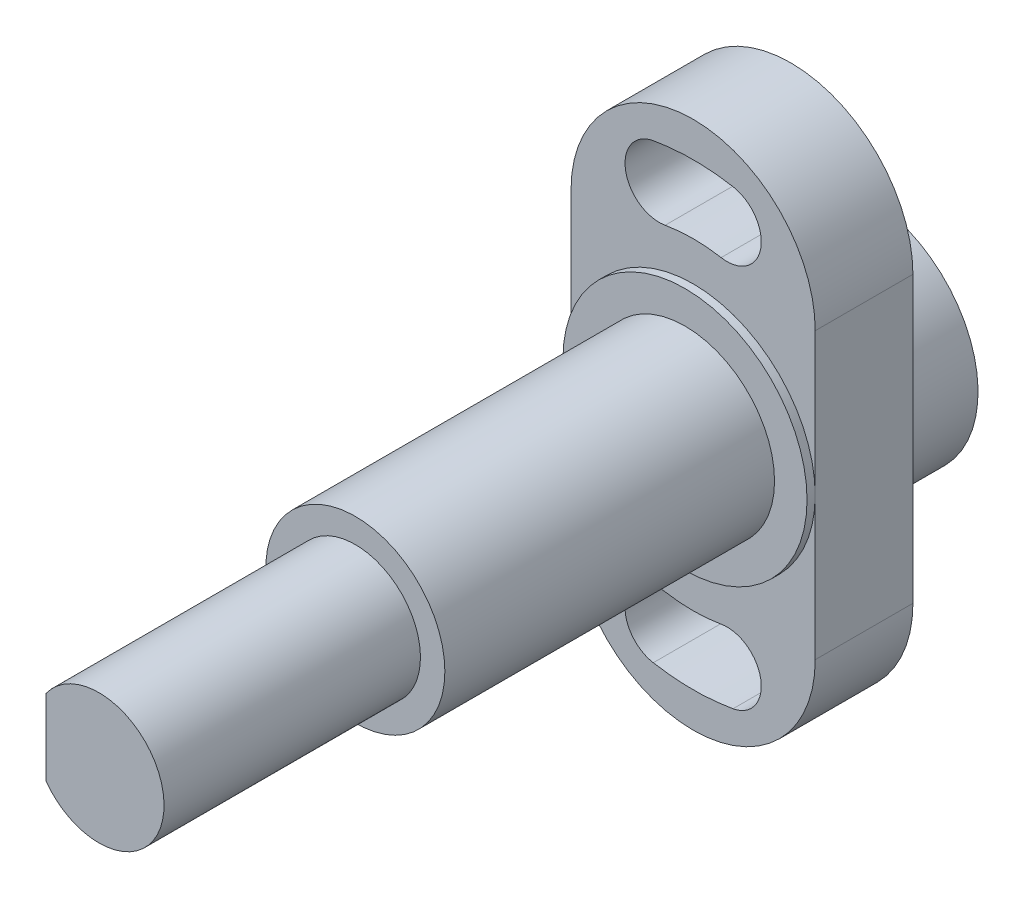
ISO-10303-21;
HEADER;
FILE_DESCRIPTION(('STEP AP214'),'2;1');
FILE_NAME('part.step','',(''),(''),'','','');
FILE_SCHEMA(('AUTOMOTIVE_DESIGN { 1 0 10303 214 1 1 1 1 }'));
ENDSEC;
DATA;
#1=APPLICATION_CONTEXT('core data for automotive mechanical design processes');
#2=APPLICATION_PROTOCOL_DEFINITION('international standard','automotive_design',2000,#1);
#3=PRODUCT_CONTEXT('',#1,'mechanical');
#4=PRODUCT('Part','Part','',(#3));
#5=PRODUCT_RELATED_PRODUCT_CATEGORY('part','',(#4));
#6=PRODUCT_DEFINITION_FORMATION('','',#4);
#7=PRODUCT_DEFINITION_CONTEXT('part definition',#1,'design');
#8=PRODUCT_DEFINITION('design','',#6,#7);
#9=PRODUCT_DEFINITION_SHAPE('','',#8);
#10=(LENGTH_UNIT() NAMED_UNIT(*) SI_UNIT(.MILLI.,.METRE.));
#11=(NAMED_UNIT(*) PLANE_ANGLE_UNIT() SI_UNIT($,.RADIAN.));
#12=(NAMED_UNIT(*) SI_UNIT($,.STERADIAN.) SOLID_ANGLE_UNIT());
#13=UNCERTAINTY_MEASURE_WITH_UNIT(LENGTH_MEASURE(1.E-05),#10,'distance_accuracy_value','');
#14=(GEOMETRIC_REPRESENTATION_CONTEXT(3) GLOBAL_UNCERTAINTY_ASSIGNED_CONTEXT((#13)) GLOBAL_UNIT_ASSIGNED_CONTEXT((#10,
#11,#12)) REPRESENTATION_CONTEXT('',''));
#15=CARTESIAN_POINT('',(0.,0.,0.));
#16=DIRECTION('',(0.,0.,1.));
#17=DIRECTION('',(1.,0.,0.));
#18=AXIS2_PLACEMENT_3D('',#15,#16,#17);
#19=CARTESIAN_POINT('',(0.,0.,-21.));
#20=DIRECTION('',(0.,0.,1.));
#21=DIRECTION('',(0.,1.,0.));
#22=AXIS2_PLACEMENT_3D('',#19,#20,#21);
#23=CYLINDRICAL_SURFACE('',#22,28.2);
#24=DIRECTION('',(0.,0.,1.));
#25=VECTOR('',#24,1.);
#26=CARTESIAN_POINT('',(4.89687861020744,-27.7715786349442,-21.));
#27=LINE('',#26,#25);
#28=CARTESIAN_POINT('',(4.89687861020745,-27.7715786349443,-12.));
#29=VERTEX_POINT('',#28);
#30=CARTESIAN_POINT('',(4.89687861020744,-27.7715786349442,0.));
#31=VERTEX_POINT('',#30);
#32=EDGE_CURVE('E194',#29,#31,#27,.T.);
#33=ORIENTED_EDGE('',*,*,#32,.F.);
#34=CARTESIAN_POINT('',(0.,0.,-12.));
#35=DIRECTION('',(0.,0.,-1.));
#36=DIRECTION('',(-1.,0.,0.));
#37=AXIS2_PLACEMENT_3D('',#34,#35,#36);
#38=CIRCLE('',#37,28.2);
#39=CARTESIAN_POINT('',(-4.89687861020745,-27.7715786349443,-12.));
#40=VERTEX_POINT('',#39);
#41=EDGE_CURVE('E140',#29,#40,#38,.T.);
#42=ORIENTED_EDGE('',*,*,#41,.T.);
#43=DIRECTION('',(0.,0.,1.));
#44=VECTOR('',#43,1.);
#45=CARTESIAN_POINT('',(-4.89687861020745,-27.7715786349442,-21.));
#46=LINE('',#45,#44);
#47=CARTESIAN_POINT('',(-4.89687861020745,-27.7715786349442,0.));
#48=VERTEX_POINT('',#47);
#49=EDGE_CURVE('E31',#40,#48,#46,.T.);
#50=ORIENTED_EDGE('',*,*,#49,.T.);
#51=CARTESIAN_POINT('',(0.,0.,0.));
#52=DIRECTION('',(0.,0.,-1.));
#53=DIRECTION('',(0.,-1.,0.));
#54=AXIS2_PLACEMENT_3D('',#51,#52,#53);
#55=CIRCLE('',#54,28.2);
#56=EDGE_CURVE('E255',#31,#48,#55,.T.);
#57=ORIENTED_EDGE('',*,*,#56,.F.);
#58=EDGE_LOOP('',(#33,#42,#50,#57));
#59=FACE_BOUND('',#58,.T.);
#60=ADVANCED_FACE('F14',(#59),#23,.F.);
#61=CARTESIAN_POINT('',(-4.16755626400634,-23.635386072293,-21.));
#62=DIRECTION('',(0.,0.,1.));
#63=DIRECTION('',(0.,1.,0.));
#64=AXIS2_PLACEMENT_3D('',#61,#62,#63);
#65=CYLINDRICAL_SURFACE('',#64,4.2);
#66=ORIENTED_EDGE('',*,*,#49,.F.);
#67=CARTESIAN_POINT('',(-4.16755626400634,-23.635386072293,-12.));
#68=DIRECTION('',(0.,0.,-1.));
#69=DIRECTION('',(-1.,0.,0.));
#70=AXIS2_PLACEMENT_3D('',#67,#68,#69);
#71=CIRCLE('',#70,4.2);
#72=CARTESIAN_POINT('',(-3.43823391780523,-19.4991935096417,-12.));
#73=VERTEX_POINT('',#72);
#74=EDGE_CURVE('E136',#40,#73,#71,.T.);
#75=ORIENTED_EDGE('',*,*,#74,.T.);
#76=DIRECTION('',(0.,0.,1.));
#77=VECTOR('',#76,1.);
#78=CARTESIAN_POINT('',(-3.43823391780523,-19.4991935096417,-21.));
#79=LINE('',#78,#77);
#80=CARTESIAN_POINT('',(-3.43823391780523,-19.4991935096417,0.));
#81=VERTEX_POINT('',#80);
#82=EDGE_CURVE('E125',#73,#81,#79,.T.);
#83=ORIENTED_EDGE('',*,*,#82,.T.);
#84=CARTESIAN_POINT('',(-4.16755626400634,-23.635386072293,0.));
#85=DIRECTION('',(0.,0.,-1.));
#86=DIRECTION('',(0.,-1.,0.));
#87=AXIS2_PLACEMENT_3D('',#84,#85,#86);
#88=CIRCLE('',#87,4.2);
#89=EDGE_CURVE('E253',#48,#81,#88,.T.);
#90=ORIENTED_EDGE('',*,*,#89,.F.);
#91=EDGE_LOOP('',(#66,#75,#83,#90));
#92=FACE_BOUND('',#91,.T.);
#93=ADVANCED_FACE('F137',(#92),#65,.F.);
#94=CARTESIAN_POINT('',(0.,0.,-21.));
#95=DIRECTION('',(0.,0.,1.));
#96=DIRECTION('',(0.,1.,0.));
#97=AXIS2_PLACEMENT_3D('',#94,#95,#96);
#98=CYLINDRICAL_SURFACE('',#97,19.8);
#99=ORIENTED_EDGE('',*,*,#82,.F.);
#100=CARTESIAN_POINT('',(0.,0.,-12.));
#101=DIRECTION('',(0.,0.,1.));
#102=DIRECTION('',(-1.,0.,0.));
#103=AXIS2_PLACEMENT_3D('',#100,#101,#102);
#104=CIRCLE('',#103,19.8);
#105=CARTESIAN_POINT('',(3.43823391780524,-19.4991935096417,-12.));
#106=VERTEX_POINT('',#105);
#107=EDGE_CURVE('E128',#73,#106,#104,.T.);
#108=ORIENTED_EDGE('',*,*,#107,.T.);
#109=DIRECTION('',(0.,0.,1.));
#110=VECTOR('',#109,1.);
#111=CARTESIAN_POINT('',(3.43823391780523,-19.4991935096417,-21.));
#112=LINE('',#111,#110);
#113=CARTESIAN_POINT('',(3.43823391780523,-19.4991935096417,0.));
#114=VERTEX_POINT('',#113);
#115=EDGE_CURVE('E133',#106,#114,#112,.T.);
#116=ORIENTED_EDGE('',*,*,#115,.T.);
#117=CARTESIAN_POINT('',(0.,0.,0.));
#118=DIRECTION('',(0.,0.,-1.));
#119=DIRECTION('',(0.,-1.,0.));
#120=AXIS2_PLACEMENT_3D('',#117,#118,#119);
#121=CIRCLE('',#120,19.8);
#122=EDGE_CURVE('E131',#81,#114,#121,.F.);
#123=ORIENTED_EDGE('',*,*,#122,.F.);
#124=EDGE_LOOP('',(#99,#108,#116,#123));
#125=FACE_BOUND('',#124,.T.);
#126=ADVANCED_FACE('F126',(#125),#98,.T.);
#127=CARTESIAN_POINT('',(4.16755626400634,-23.635386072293,-21.));
#128=DIRECTION('',(0.,0.,1.));
#129=DIRECTION('',(0.,1.,0.));
#130=AXIS2_PLACEMENT_3D('',#127,#128,#129);
#131=CYLINDRICAL_SURFACE('',#130,4.2);
#132=ORIENTED_EDGE('',*,*,#115,.F.);
#133=CARTESIAN_POINT('',(4.16755626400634,-23.635386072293,-12.));
#134=DIRECTION('',(0.,0.,-1.));
#135=DIRECTION('',(-1.,0.,0.));
#136=AXIS2_PLACEMENT_3D('',#133,#134,#135);
#137=CIRCLE('',#136,4.2);
#138=EDGE_CURVE('E144',#106,#29,#137,.T.);
#139=ORIENTED_EDGE('',*,*,#138,.T.);
#140=ORIENTED_EDGE('',*,*,#32,.T.);
#141=CARTESIAN_POINT('',(4.16755626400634,-23.635386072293,0.));
#142=DIRECTION('',(0.,0.,-1.));
#143=DIRECTION('',(0.,-1.,0.));
#144=AXIS2_PLACEMENT_3D('',#141,#142,#143);
#145=CIRCLE('',#144,4.2);
#146=EDGE_CURVE('E258',#114,#31,#145,.T.);
#147=ORIENTED_EDGE('',*,*,#146,.F.);
#148=EDGE_LOOP('',(#132,#139,#140,#147));
#149=FACE_BOUND('',#148,.T.);
#150=ADVANCED_FACE('F293',(#149),#131,.F.);
#151=CARTESIAN_POINT('',(0.,0.,-21.));
#152=DIRECTION('',(0.,0.,1.));
#153=DIRECTION('',(0.,1.,0.));
#154=AXIS2_PLACEMENT_3D('',#151,#152,#153);
#155=CYLINDRICAL_SURFACE('',#154,28.2);
#156=DIRECTION('',(0.,0.,1.));
#157=VECTOR('',#156,1.);
#158=CARTESIAN_POINT('',(-4.89687861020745,27.7715786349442,-21.));
#159=LINE('',#158,#157);
#160=CARTESIAN_POINT('',(-4.89687861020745,27.7715786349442,-12.));
#161=VERTEX_POINT('',#160);
#162=CARTESIAN_POINT('',(-4.89687861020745,27.7715786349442,0.));
#163=VERTEX_POINT('',#162);
#164=EDGE_CURVE('E39',#161,#163,#159,.T.);
#165=ORIENTED_EDGE('',*,*,#164,.F.);
#166=CARTESIAN_POINT('',(0.,0.,-12.));
#167=DIRECTION('',(0.,0.,-1.));
#168=DIRECTION('',(-1.,0.,0.));
#169=AXIS2_PLACEMENT_3D('',#166,#167,#168);
#170=CIRCLE('',#169,28.2);
#171=CARTESIAN_POINT('',(4.89687861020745,27.7715786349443,-12.));
#172=VERTEX_POINT('',#171);
#173=EDGE_CURVE('E151',#161,#172,#170,.T.);
#174=ORIENTED_EDGE('',*,*,#173,.T.);
#175=DIRECTION('',(0.,0.,1.));
#176=VECTOR('',#175,1.);
#177=CARTESIAN_POINT('',(4.89687861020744,27.7715786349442,-21.));
#178=LINE('',#177,#176);
#179=CARTESIAN_POINT('',(4.89687861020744,27.7715786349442,0.));
#180=VERTEX_POINT('',#179);
#181=EDGE_CURVE('E189',#172,#180,#178,.T.);
#182=ORIENTED_EDGE('',*,*,#181,.T.);
#183=CARTESIAN_POINT('',(0.,0.,0.));
#184=DIRECTION('',(0.,0.,-1.));
#185=DIRECTION('',(0.,-1.,0.));
#186=AXIS2_PLACEMENT_3D('',#183,#184,#185);
#187=CIRCLE('',#186,28.2);
#188=EDGE_CURVE('E23',#163,#180,#187,.T.);
#189=ORIENTED_EDGE('',*,*,#188,.F.);
#190=EDGE_LOOP('',(#165,#174,#182,#189));
#191=FACE_BOUND('',#190,.T.);
#192=ADVANCED_FACE('F341',(#191),#155,.F.);
#193=CARTESIAN_POINT('',(4.16755626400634,23.635386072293,-21.));
#194=DIRECTION('',(0.,0.,1.));
#195=DIRECTION('',(0.,1.,0.));
#196=AXIS2_PLACEMENT_3D('',#193,#194,#195);
#197=CYLINDRICAL_SURFACE('',#196,4.2);
#198=ORIENTED_EDGE('',*,*,#181,.F.);
#199=CARTESIAN_POINT('',(4.16755626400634,23.635386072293,-12.));
#200=DIRECTION('',(0.,0.,-1.));
#201=DIRECTION('',(-1.,0.,0.));
#202=AXIS2_PLACEMENT_3D('',#199,#200,#201);
#203=CIRCLE('',#202,4.2);
#204=CARTESIAN_POINT('',(3.43823391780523,19.4991935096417,-12.));
#205=VERTEX_POINT('',#204);
#206=EDGE_CURVE('E153',#172,#205,#203,.T.);
#207=ORIENTED_EDGE('',*,*,#206,.T.);
#208=DIRECTION('',(0.,0.,1.));
#209=VECTOR('',#208,1.);
#210=CARTESIAN_POINT('',(3.43823391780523,19.4991935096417,-21.));
#211=LINE('',#210,#209);
#212=CARTESIAN_POINT('',(3.43823391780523,19.4991935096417,0.));
#213=VERTEX_POINT('',#212);
#214=EDGE_CURVE('E191',#205,#213,#211,.T.);
#215=ORIENTED_EDGE('',*,*,#214,.T.);
#216=CARTESIAN_POINT('',(4.16755626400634,23.635386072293,0.));
#217=DIRECTION('',(0.,0.,-1.));
#218=DIRECTION('',(0.,-1.,0.));
#219=AXIS2_PLACEMENT_3D('',#216,#217,#218);
#220=CIRCLE('',#219,4.2);
#221=EDGE_CURVE('E264',#180,#213,#220,.T.);
#222=ORIENTED_EDGE('',*,*,#221,.F.);
#223=EDGE_LOOP('',(#198,#207,#215,#222));
#224=FACE_BOUND('',#223,.T.);
#225=ADVANCED_FACE('F434',(#224),#197,.F.);
#226=CARTESIAN_POINT('',(0.,0.,-21.));
#227=DIRECTION('',(0.,0.,1.));
#228=DIRECTION('',(0.,1.,0.));
#229=AXIS2_PLACEMENT_3D('',#226,#227,#228);
#230=CYLINDRICAL_SURFACE('',#229,19.8);
#231=ORIENTED_EDGE('',*,*,#214,.F.);
#232=CARTESIAN_POINT('',(0.,0.,-12.));
#233=DIRECTION('',(0.,0.,1.));
#234=DIRECTION('',(-1.,0.,0.));
#235=AXIS2_PLACEMENT_3D('',#232,#233,#234);
#236=CIRCLE('',#235,19.8);
#237=CARTESIAN_POINT('',(-3.43823391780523,19.4991935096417,-12.));
#238=VERTEX_POINT('',#237);
#239=EDGE_CURVE('E156',#205,#238,#236,.T.);
#240=ORIENTED_EDGE('',*,*,#239,.T.);
#241=DIRECTION('',(0.,0.,1.));
#242=VECTOR('',#241,1.);
#243=CARTESIAN_POINT('',(-3.43823391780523,19.4991935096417,-21.));
#244=LINE('',#243,#242);
#245=CARTESIAN_POINT('',(-3.43823391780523,19.4991935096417,0.));
#246=VERTEX_POINT('',#245);
#247=EDGE_CURVE('E187',#238,#246,#244,.T.);
#248=ORIENTED_EDGE('',*,*,#247,.T.);
#249=CARTESIAN_POINT('',(0.,0.,0.));
#250=DIRECTION('',(0.,0.,-1.));
#251=DIRECTION('',(0.,-1.,0.));
#252=AXIS2_PLACEMENT_3D('',#249,#250,#251);
#253=CIRCLE('',#252,19.8);
#254=EDGE_CURVE('E261',#213,#246,#253,.F.);
#255=ORIENTED_EDGE('',*,*,#254,.F.);
#256=EDGE_LOOP('',(#231,#240,#248,#255));
#257=FACE_BOUND('',#256,.T.);
#258=ADVANCED_FACE('F426',(#257),#230,.T.);
#259=CARTESIAN_POINT('',(-4.16755626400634,23.635386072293,-21.));
#260=DIRECTION('',(0.,0.,1.));
#261=DIRECTION('',(0.,1.,0.));
#262=AXIS2_PLACEMENT_3D('',#259,#260,#261);
#263=CYLINDRICAL_SURFACE('',#262,4.2);
#264=ORIENTED_EDGE('',*,*,#247,.F.);
#265=CARTESIAN_POINT('',(-4.16755626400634,23.635386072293,-12.));
#266=DIRECTION('',(0.,0.,-1.));
#267=DIRECTION('',(-1.,0.,0.));
#268=AXIS2_PLACEMENT_3D('',#265,#266,#267);
#269=CIRCLE('',#268,4.2);
#270=EDGE_CURVE('E146',#238,#161,#269,.T.);
#271=ORIENTED_EDGE('',*,*,#270,.T.);
#272=ORIENTED_EDGE('',*,*,#164,.T.);
#273=CARTESIAN_POINT('',(-4.16755626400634,23.635386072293,0.));
#274=DIRECTION('',(0.,0.,-1.));
#275=DIRECTION('',(0.,-1.,0.));
#276=AXIS2_PLACEMENT_3D('',#273,#274,#275);
#277=CIRCLE('',#276,4.2);
#278=EDGE_CURVE('E9',#246,#163,#277,.T.);
#279=ORIENTED_EDGE('',*,*,#278,.F.);
#280=EDGE_LOOP('',(#264,#271,#272,#279));
#281=FACE_BOUND('',#280,.T.);
#282=ADVANCED_FACE('F334',(#281),#263,.F.);
#283=CARTESIAN_POINT('',(-11.,0.,1.));
#284=DIRECTION('',(0.,0.,1.));
#285=DIRECTION('',(0.,1.,0.));
#286=AXIS2_PLACEMENT_3D('',#283,#284,#285);
#287=PLANE('',#286);
#288=CARTESIAN_POINT('',(0.,0.,1.));
#289=DIRECTION('',(0.,0.,1.));
#290=DIRECTION('',(0.,1.,0.));
#291=AXIS2_PLACEMENT_3D('',#288,#289,#290);
#292=CIRCLE('',#291,11.);
#293=CARTESIAN_POINT('',(0.,11.,1.));
#294=VERTEX_POINT('',#293);
#295=EDGE_CURVE('E238',#294,#294,#292,.F.);
#296=ORIENTED_EDGE('',*,*,#295,.T.);
#297=EDGE_LOOP('',(#296));
#298=FACE_BOUND('',#297,.T.);
#299=CARTESIAN_POINT('',(0.,0.,1.));
#300=DIRECTION('',(0.,0.,-1.));
#301=DIRECTION('',(0.,-1.,0.));
#302=AXIS2_PLACEMENT_3D('',#299,#300,#301);
#303=CIRCLE('',#302,14.995);
#304=CARTESIAN_POINT('',(0.,-14.995,1.));
#305=VERTEX_POINT('',#304);
#306=EDGE_CURVE('E235',#305,#305,#303,.T.);
#307=ORIENTED_EDGE('',*,*,#306,.F.);
#308=EDGE_LOOP('',(#307));
#309=FACE_BOUND('',#308,.T.);
#310=ADVANCED_FACE('F322',(#298,#309),#287,.T.);
#311=CARTESIAN_POINT('',(-15.,10.,-6.));
#312=DIRECTION('',(-1.,0.,0.));
#313=DIRECTION('',(0.,-1.,0.));
#314=AXIS2_PLACEMENT_3D('',#311,#312,#313);
#315=CONICAL_SURFACE('',#314,2.65,0.78539816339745);
#316=CARTESIAN_POINT('',(-14.85,10.,-6.));
#317=DIRECTION('',(-1.,0.,0.));
#318=DIRECTION('',(0.,0.,1.));
#319=AXIS2_PLACEMENT_3D('',#316,#317,#318);
#320=CIRCLE('',#319,2.5);
#321=CARTESIAN_POINT('',(-14.85,10.,-3.5));
#322=VERTEX_POINT('',#321);
#323=EDGE_CURVE('E277',#322,#322,#320,.F.);
#324=ORIENTED_EDGE('',*,*,#323,.T.);
#325=EDGE_LOOP('',(#324));
#326=FACE_BOUND('',#325,.T.);
#327=CARTESIAN_POINT('',(-15.,10.,-6.));
#328=DIRECTION('',(-1.,0.,0.));
#329=DIRECTION('',(0.,-1.,0.));
#330=AXIS2_PLACEMENT_3D('',#327,#328,#329);
#331=CIRCLE('',#330,2.65);
#332=CARTESIAN_POINT('',(-15.,7.35,-6.));
#333=VERTEX_POINT('',#332);
#334=EDGE_CURVE('E177',#333,#333,#331,.T.);
#335=ORIENTED_EDGE('',*,*,#334,.T.);
#336=EDGE_LOOP('',(#335));
#337=FACE_BOUND('',#336,.T.);
#338=ADVANCED_FACE('F310',(#326,#337),#315,.F.);
#339=CARTESIAN_POINT('',(0.,0.,-12.));
#340=DIRECTION('',(0.,0.,-1.));
#341=DIRECTION('',(0.,-1.,0.));
#342=AXIS2_PLACEMENT_3D('',#339,#340,#341);
#343=CYLINDRICAL_SURFACE('',#342,14.995);
#344=ORIENTED_EDGE('',*,*,#306,.T.);
#345=EDGE_LOOP('',(#344));
#346=FACE_BOUND('',#345,.T.);
#347=CARTESIAN_POINT('',(0.,0.,0.));
#348=DIRECTION('',(0.,0.,1.));
#349=DIRECTION('',(0.,1.,0.));
#350=AXIS2_PLACEMENT_3D('',#347,#348,#349);
#351=CIRCLE('',#350,14.995);
#352=CARTESIAN_POINT('',(0.,14.995,0.));
#353=VERTEX_POINT('',#352);
#354=EDGE_CURVE('E215',#353,#353,#351,.T.);
#355=ORIENTED_EDGE('',*,*,#354,.T.);
#356=EDGE_LOOP('',(#355));
#357=FACE_BOUND('',#356,.T.);
#358=ADVANCED_FACE('F307',(#346,#357),#343,.T.);
#359=CARTESIAN_POINT('',(15.,-17.5,0.));
#360=DIRECTION('',(-1.,0.,0.));
#361=DIRECTION('',(0.,-1.,0.));
#362=AXIS2_PLACEMENT_3D('',#359,#360,#361);
#363=PLANE('',#362);
#364=DIRECTION('',(0.,-1.,0.));
#365=VECTOR('',#364,1.);
#366=CARTESIAN_POINT('',(15.,17.5,-12.));
#367=LINE('',#366,#365);
#368=CARTESIAN_POINT('',(15.,17.5,-12.));
#369=VERTEX_POINT('',#368);
#370=CARTESIAN_POINT('',(15.,-17.5,-12.));
#371=VERTEX_POINT('',#370);
#372=EDGE_CURVE('E165',#369,#371,#367,.T.);
#373=ORIENTED_EDGE('',*,*,#372,.F.);
#374=DIRECTION('',(0.,0.,-1.));
#375=VECTOR('',#374,1.);
#376=CARTESIAN_POINT('',(15.,17.5,0.));
#377=LINE('',#376,#375);
#378=CARTESIAN_POINT('',(15.,17.5,0.));
#379=VERTEX_POINT('',#378);
#380=EDGE_CURVE('E227',#379,#369,#377,.T.);
#381=ORIENTED_EDGE('',*,*,#380,.F.);
#382=DIRECTION('',(0.,1.,0.));
#383=VECTOR('',#382,1.);
#384=CARTESIAN_POINT('',(15.,-17.5,0.));
#385=LINE('',#384,#383);
#386=CARTESIAN_POINT('',(15.,-17.5,0.));
#387=VERTEX_POINT('',#386);
#388=EDGE_CURVE('E225',#387,#379,#385,.T.);
#389=ORIENTED_EDGE('',*,*,#388,.F.);
#390=DIRECTION('',(0.,0.,-1.));
#391=VECTOR('',#390,1.);
#392=CARTESIAN_POINT('',(15.,-17.5,0.));
#393=LINE('',#392,#391);
#394=EDGE_CURVE('E229',#387,#371,#393,.T.);
#395=ORIENTED_EDGE('',*,*,#394,.T.);
#396=EDGE_LOOP('',(#373,#381,#389,#395));
#397=FACE_BOUND('',#396,.T.);
#398=ADVANCED_FACE('F309',(#397),#363,.F.);
#399=CARTESIAN_POINT('',(0.,17.5,0.));
#400=DIRECTION('',(0.,0.,-1.));
#401=DIRECTION('',(0.,-1.,0.));
#402=AXIS2_PLACEMENT_3D('',#399,#400,#401);
#403=CYLINDRICAL_SURFACE('',#402,15.);
#404=CARTESIAN_POINT('',(0.,17.5,-12.));
#405=DIRECTION('',(0.,0.,-1.));
#406=DIRECTION('',(-1.,0.,0.));
#407=AXIS2_PLACEMENT_3D('',#404,#405,#406);
#408=CIRCLE('',#407,15.);
#409=CARTESIAN_POINT('',(-15.,17.5,-12.));
#410=VERTEX_POINT('',#409);
#411=EDGE_CURVE('E162',#410,#369,#408,.T.);
#412=ORIENTED_EDGE('',*,*,#411,.F.);
#413=DIRECTION('',(0.,0.,-1.));
#414=VECTOR('',#413,1.);
#415=CARTESIAN_POINT('',(-15.,17.5,0.));
#416=LINE('',#415,#414);
#417=CARTESIAN_POINT('',(-15.,17.5,0.));
#418=VERTEX_POINT('',#417);
#419=EDGE_CURVE('E233',#418,#410,#416,.T.);
#420=ORIENTED_EDGE('',*,*,#419,.F.);
#421=CARTESIAN_POINT('',(0.,17.5,0.));
#422=DIRECTION('',(0.,0.,1.));
#423=DIRECTION('',(0.,-1.,0.));
#424=AXIS2_PLACEMENT_3D('',#421,#422,#423);
#425=CIRCLE('',#424,15.);
#426=EDGE_CURVE('E218',#379,#418,#425,.T.);
#427=ORIENTED_EDGE('',*,*,#426,.F.);
#428=ORIENTED_EDGE('',*,*,#380,.T.);
#429=EDGE_LOOP('',(#412,#420,#427,#428));
#430=FACE_BOUND('',#429,.T.);
#431=ADVANCED_FACE('F319',(#430),#403,.T.);
#432=CARTESIAN_POINT('',(-15.,-17.5,0.));
#433=DIRECTION('',(1.,0.,0.));
#434=DIRECTION('',(0.,1.,0.));
#435=AXIS2_PLACEMENT_3D('',#432,#433,#434);
#436=PLANE('',#435);
#437=DIRECTION('',(0.,1.,0.));
#438=VECTOR('',#437,1.);
#439=CARTESIAN_POINT('',(-15.,-17.5,-12.));
#440=LINE('',#439,#438);
#441=CARTESIAN_POINT('',(-15.,-17.5,-12.));
#442=VERTEX_POINT('',#441);
#443=EDGE_CURVE('E171',#442,#410,#440,.T.);
#444=ORIENTED_EDGE('',*,*,#443,.F.);
#445=DIRECTION('',(0.,0.,-1.));
#446=VECTOR('',#445,1.);
#447=CARTESIAN_POINT('',(-15.,-17.5,0.));
#448=LINE('',#447,#446);
#449=CARTESIAN_POINT('',(-15.,-17.5,0.));
#450=VERTEX_POINT('',#449);
#451=EDGE_CURVE('E231',#450,#442,#448,.T.);
#452=ORIENTED_EDGE('',*,*,#451,.F.);
#453=DIRECTION('',(0.,-1.,0.));
#454=VECTOR('',#453,1.);
#455=CARTESIAN_POINT('',(-15.,-17.5,0.));
#456=LINE('',#455,#454);
#457=EDGE_CURVE('E221',#418,#450,#456,.T.);
#458=ORIENTED_EDGE('',*,*,#457,.F.);
#459=ORIENTED_EDGE('',*,*,#419,.T.);
#460=EDGE_LOOP('',(#444,#452,#458,#459));
#461=FACE_BOUND('',#460,.T.);
#462=ORIENTED_EDGE('',*,*,#334,.F.);
#463=EDGE_LOOP('',(#462));
#464=FACE_BOUND('',#463,.T.);
#465=ADVANCED_FACE('F384',(#461,#464),#436,.F.);
#466=CARTESIAN_POINT('',(0.,-17.5,0.));
#467=DIRECTION('',(0.,0.,-1.));
#468=DIRECTION('',(0.,-1.,0.));
#469=AXIS2_PLACEMENT_3D('',#466,#467,#468);
#470=CYLINDRICAL_SURFACE('',#469,15.);
#471=CARTESIAN_POINT('',(0.,-17.5,-12.));
#472=DIRECTION('',(0.,0.,-1.));
#473=DIRECTION('',(-1.,0.,0.));
#474=AXIS2_PLACEMENT_3D('',#471,#472,#473);
#475=CIRCLE('',#474,15.);
#476=EDGE_CURVE('E168',#371,#442,#475,.T.);
#477=ORIENTED_EDGE('',*,*,#476,.F.);
#478=ORIENTED_EDGE('',*,*,#394,.F.);
#479=CARTESIAN_POINT('',(0.,-17.5,0.));
#480=DIRECTION('',(0.,0.,1.));
#481=DIRECTION('',(0.,1.,0.));
#482=AXIS2_PLACEMENT_3D('',#479,#480,#481);
#483=CIRCLE('',#482,15.);
#484=EDGE_CURVE('E223',#450,#387,#483,.T.);
#485=ORIENTED_EDGE('',*,*,#484,.F.);
#486=ORIENTED_EDGE('',*,*,#451,.T.);
#487=EDGE_LOOP('',(#477,#478,#485,#486));
#488=FACE_BOUND('',#487,.T.);
#489=ADVANCED_FACE('F299',(#488),#470,.T.);
#490=CARTESIAN_POINT('',(0.,17.5,0.));
#491=DIRECTION('',(0.,0.,-1.));
#492=DIRECTION('',(0.,-1.,0.));
#493=AXIS2_PLACEMENT_3D('',#490,#491,#492);
#494=PLANE('',#493);
#495=ORIENTED_EDGE('',*,*,#254,.T.);
#496=ORIENTED_EDGE('',*,*,#278,.T.);
#497=ORIENTED_EDGE('',*,*,#188,.T.);
#498=ORIENTED_EDGE('',*,*,#221,.T.);
#499=EDGE_LOOP('',(#495,#496,#497,#498));
#500=FACE_BOUND('',#499,.T.);
#501=ORIENTED_EDGE('',*,*,#122,.T.);
#502=ORIENTED_EDGE('',*,*,#146,.T.);
#503=ORIENTED_EDGE('',*,*,#56,.T.);
#504=ORIENTED_EDGE('',*,*,#89,.T.);
#505=EDGE_LOOP('',(#501,#502,#503,#504));
#506=FACE_BOUND('',#505,.T.);
#507=ORIENTED_EDGE('',*,*,#426,.T.);
#508=ORIENTED_EDGE('',*,*,#457,.T.);
#509=ORIENTED_EDGE('',*,*,#484,.T.);
#510=ORIENTED_EDGE('',*,*,#388,.T.);
#511=EDGE_LOOP('',(#507,#508,#509,#510));
#512=FACE_BOUND('',#511,.T.);
#513=ORIENTED_EDGE('',*,*,#354,.F.);
#514=EDGE_LOOP('',(#513));
#515=FACE_BOUND('',#514,.T.);
#516=ADVANCED_FACE('F295',(#500,#506,#512,#515),#494,.F.);
#517=CARTESIAN_POINT('',(-8.,0.,-21.));
#518=DIRECTION('',(0.,0.,-1.));
#519=DIRECTION('',(0.,-1.,0.));
#520=AXIS2_PLACEMENT_3D('',#517,#518,#519);
#521=PLANE('',#520);
#522=CARTESIAN_POINT('',(0.,0.,-21.));
#523=DIRECTION('',(0.,0.,-1.));
#524=DIRECTION('',(0.,-1.,0.));
#525=AXIS2_PLACEMENT_3D('',#522,#523,#524);
#526=CIRCLE('',#525,14.);
#527=CARTESIAN_POINT('',(0.,-14.,-21.));
#528=VERTEX_POINT('',#527);
#529=EDGE_CURVE('E196',#528,#528,#526,.T.);
#530=ORIENTED_EDGE('',*,*,#529,.T.);
#531=EDGE_LOOP('',(#530));
#532=FACE_BOUND('',#531,.T.);
#533=ADVANCED_FACE('F298',(#532),#521,.T.);
#534=CARTESIAN_POINT('',(0.,0.,-12.));
#535=DIRECTION('',(0.,0.,-1.));
#536=DIRECTION('',(0.,-1.,0.));
#537=AXIS2_PLACEMENT_3D('',#534,#535,#536);
#538=CYLINDRICAL_SURFACE('',#537,14.);
#539=CARTESIAN_POINT('',(0.,0.,-12.));
#540=DIRECTION('',(0.,0.,-1.));
#541=DIRECTION('',(0.,-1.,0.));
#542=AXIS2_PLACEMENT_3D('',#539,#540,#541);
#543=CIRCLE('',#542,14.);
#544=CARTESIAN_POINT('',(0.,-14.,-12.));
#545=VERTEX_POINT('',#544);
#546=EDGE_CURVE('E249',#545,#545,#543,.T.);
#547=ORIENTED_EDGE('',*,*,#546,.T.);
#548=EDGE_LOOP('',(#547));
#549=FACE_BOUND('',#548,.T.);
#550=ORIENTED_EDGE('',*,*,#529,.F.);
#551=EDGE_LOOP('',(#550));
#552=FACE_BOUND('',#551,.T.);
#553=ADVANCED_FACE('F342',(#549,#552),#538,.T.);
#554=CARTESIAN_POINT('',(-8.,0.,-12.));
#555=DIRECTION('',(0.,0.,-1.));
#556=DIRECTION('',(0.,-1.,0.));
#557=AXIS2_PLACEMENT_3D('',#554,#555,#556);
#558=PLANE('',#557);
#559=ORIENTED_EDGE('',*,*,#41,.F.);
#560=ORIENTED_EDGE('',*,*,#138,.F.);
#561=ORIENTED_EDGE('',*,*,#107,.F.);
#562=ORIENTED_EDGE('',*,*,#74,.F.);
#563=EDGE_LOOP('',(#559,#560,#561,#562));
#564=FACE_BOUND('',#563,.T.);
#565=ORIENTED_EDGE('',*,*,#270,.F.);
#566=ORIENTED_EDGE('',*,*,#239,.F.);
#567=ORIENTED_EDGE('',*,*,#206,.F.);
#568=ORIENTED_EDGE('',*,*,#173,.F.);
#569=EDGE_LOOP('',(#565,#566,#567,#568));
#570=FACE_BOUND('',#569,.T.);
#571=ORIENTED_EDGE('',*,*,#546,.F.);
#572=EDGE_LOOP('',(#571));
#573=FACE_BOUND('',#572,.T.);
#574=ORIENTED_EDGE('',*,*,#411,.T.);
#575=ORIENTED_EDGE('',*,*,#372,.T.);
#576=ORIENTED_EDGE('',*,*,#476,.T.);
#577=ORIENTED_EDGE('',*,*,#443,.T.);
#578=EDGE_LOOP('',(#574,#575,#576,#577));
#579=FACE_BOUND('',#578,.T.);
#580=ADVANCED_FACE('F16',(#564,#570,#573,#579),#558,.T.);
#581=CARTESIAN_POINT('',(0.,0.,-12.));
#582=DIRECTION('',(0.,0.,-1.));
#583=DIRECTION('',(0.,-1.,0.));
#584=AXIS2_PLACEMENT_3D('',#581,#582,#583);
#585=CYLINDRICAL_SURFACE('',#584,11.);
#586=ORIENTED_EDGE('',*,*,#295,.F.);
#587=EDGE_LOOP('',(#586));
#588=FACE_BOUND('',#587,.T.);
#589=CARTESIAN_POINT('',(0.,0.,41.5));
#590=DIRECTION('',(0.,0.,1.));
#591=DIRECTION('',(1.,0.,0.));
#592=AXIS2_PLACEMENT_3D('',#589,#590,#591);
#593=CIRCLE('',#592,11.);
#594=CARTESIAN_POINT('',(11.,0.,41.5));
#595=VERTEX_POINT('',#594);
#596=EDGE_CURVE('E174',#595,#595,#593,.T.);
#597=ORIENTED_EDGE('',*,*,#596,.F.);
#598=EDGE_LOOP('',(#597));
#599=FACE_BOUND('',#598,.T.);
#600=ADVANCED_FACE('F353',(#588,#599),#585,.T.);
#601=CARTESIAN_POINT('',(-6.5,0.,69.));
#602=DIRECTION('',(-1.,0.,0.));
#603=DIRECTION('',(0.,-1.,0.));
#604=AXIS2_PLACEMENT_3D('',#601,#602,#603);
#605=CONICAL_SURFACE('',#604,2.65,0.785398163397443);
#606=CARTESIAN_POINT('',(-6.35,0.,69.));
#607=DIRECTION('',(-1.,0.,0.));
#608=DIRECTION('',(0.,0.,1.));
#609=AXIS2_PLACEMENT_3D('',#606,#607,#608);
#610=CIRCLE('',#609,2.5);
#611=CARTESIAN_POINT('',(-6.35,0.,71.5));
#612=VERTEX_POINT('',#611);
#613=EDGE_CURVE('E271',#612,#612,#610,.F.);
#614=ORIENTED_EDGE('',*,*,#613,.T.);
#615=EDGE_LOOP('',(#614));
#616=FACE_BOUND('',#615,.T.);
#617=CARTESIAN_POINT('',(-6.5,0.,69.));
#618=DIRECTION('',(-1.,0.,0.));
#619=DIRECTION('',(0.,-1.,0.));
#620=AXIS2_PLACEMENT_3D('',#617,#618,#619);
#621=CIRCLE('',#620,2.65);
#622=CARTESIAN_POINT('',(-6.5,-2.65,69.));
#623=VERTEX_POINT('',#622);
#624=EDGE_CURVE('E201',#623,#623,#621,.T.);
#625=ORIENTED_EDGE('',*,*,#624,.T.);
#626=EDGE_LOOP('',(#625));
#627=FACE_BOUND('',#626,.T.);
#628=ADVANCED_FACE('F349',(#616,#627),#605,.F.);
#629=CARTESIAN_POINT('',(-6.5,-10.,63.));
#630=DIRECTION('',(0.500000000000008,0.,-0.866025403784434));
#631=DIRECTION('',(-0.866025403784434,0.,-0.500000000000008));
#632=AXIS2_PLACEMENT_3D('',#629,#630,#631);
#633=PLANE('',#632);
#634=CARTESIAN_POINT('',(0.,0.,66.7527767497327));
#635=DIRECTION('',(0.500000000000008,0.,-0.866025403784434));
#636=DIRECTION('',(-0.866025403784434,0.,-0.500000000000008));
#637=AXIS2_PLACEMENT_3D('',#634,#635,#636);
#638=ELLIPSE('',#637,9.23760430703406,8.);
#639=CARTESIAN_POINT('',(-6.5,-4.66368952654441,63.));
#640=VERTEX_POINT('',#639);
#641=CARTESIAN_POINT('',(-6.5,4.6636895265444,63.));
#642=VERTEX_POINT('',#641);
#643=EDGE_CURVE('E241',#640,#642,#638,.T.);
#644=ORIENTED_EDGE('',*,*,#643,.F.);
#645=DIRECTION('',(0.,1.,0.));
#646=VECTOR('',#645,1.);
#647=CARTESIAN_POINT('',(-6.5,-10.,63.));
#648=LINE('',#647,#646);
#649=EDGE_CURVE('E207',#640,#642,#648,.T.);
#650=ORIENTED_EDGE('',*,*,#649,.T.);
#651=EDGE_LOOP('',(#644,#650));
#652=FACE_BOUND('',#651,.T.);
#653=ADVANCED_FACE('F352',(#652),#633,.F.);
#654=CARTESIAN_POINT('',(0.,0.,73.));
#655=DIRECTION('',(0.,0.,1.));
#656=DIRECTION('',(0.,1.,0.));
#657=AXIS2_PLACEMENT_3D('',#654,#655,#656);
#658=PLANE('',#657);
#659=DIRECTION('',(0.,1.,0.));
#660=VECTOR('',#659,1.);
#661=CARTESIAN_POINT('',(-6.5,-10.,73.));
#662=LINE('',#661,#660);
#663=CARTESIAN_POINT('',(-6.5,-4.6636895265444,73.));
#664=VERTEX_POINT('',#663);
#665=CARTESIAN_POINT('',(-6.5,4.6636895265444,73.));
#666=VERTEX_POINT('',#665);
#667=EDGE_CURVE('E208',#664,#666,#662,.T.);
#668=ORIENTED_EDGE('',*,*,#667,.F.);
#669=CARTESIAN_POINT('',(0.,0.,73.));
#670=DIRECTION('',(0.,0.,1.));
#671=DIRECTION('',(1.,0.,0.));
#672=AXIS2_PLACEMENT_3D('',#669,#670,#671);
#673=CIRCLE('',#672,8.);
#674=EDGE_CURVE('E159',#664,#666,#673,.T.);
#675=ORIENTED_EDGE('',*,*,#674,.T.);
#676=EDGE_LOOP('',(#668,#675));
#677=FACE_BOUND('',#676,.T.);
#678=ADVANCED_FACE('F367',(#677),#658,.T.);
#679=CARTESIAN_POINT('',(-6.5,-10.,73.));
#680=DIRECTION('',(1.,0.,0.));
#681=DIRECTION('',(0.,0.,-1.));
#682=AXIS2_PLACEMENT_3D('',#679,#680,#681);
#683=PLANE('',#682);
#684=ORIENTED_EDGE('',*,*,#667,.T.);
#685=DIRECTION('',(0.,0.,-1.));
#686=VECTOR('',#685,1.);
#687=CARTESIAN_POINT('',(-6.5,4.6636895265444,-12.));
#688=LINE('',#687,#686);
#689=EDGE_CURVE('E243',#642,#666,#688,.F.);
#690=ORIENTED_EDGE('',*,*,#689,.F.);
#691=ORIENTED_EDGE('',*,*,#649,.F.);
#692=DIRECTION('',(0.,0.,-1.));
#693=VECTOR('',#692,1.);
#694=CARTESIAN_POINT('',(-6.5,-4.6636895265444,-12.));
#695=LINE('',#694,#693);
#696=EDGE_CURVE('E246',#664,#640,#695,.T.);
#697=ORIENTED_EDGE('',*,*,#696,.F.);
#698=EDGE_LOOP('',(#684,#690,#691,#697));
#699=FACE_BOUND('',#698,.T.);
#700=ORIENTED_EDGE('',*,*,#624,.F.);
#701=EDGE_LOOP('',(#700));
#702=FACE_BOUND('',#701,.T.);
#703=ADVANCED_FACE('F369',(#699,#702),#683,.F.);
#704=CARTESIAN_POINT('',(0.,0.,-12.));
#705=DIRECTION('',(0.,0.,-1.));
#706=DIRECTION('',(0.,-1.,0.));
#707=AXIS2_PLACEMENT_3D('',#704,#705,#706);
#708=CYLINDRICAL_SURFACE('',#707,8.);
#709=ORIENTED_EDGE('',*,*,#689,.T.);
#710=ORIENTED_EDGE('',*,*,#674,.F.);
#711=ORIENTED_EDGE('',*,*,#696,.T.);
#712=ORIENTED_EDGE('',*,*,#643,.T.);
#713=EDGE_LOOP('',(#709,#710,#711,#712));
#714=FACE_BOUND('',#713,.T.);
#715=CARTESIAN_POINT('',(0.,0.,41.5));
#716=DIRECTION('',(0.,0.,-1.));
#717=DIRECTION('',(0.,-1.,0.));
#718=AXIS2_PLACEMENT_3D('',#715,#716,#717);
#719=CIRCLE('',#718,8.);
#720=CARTESIAN_POINT('',(0.,-8.,41.5));
#721=VERTEX_POINT('',#720);
#722=EDGE_CURVE('E210',#721,#721,#719,.T.);
#723=ORIENTED_EDGE('',*,*,#722,.F.);
#724=EDGE_LOOP('',(#723));
#725=FACE_BOUND('',#724,.T.);
#726=ADVANCED_FACE('F372',(#714,#725),#708,.T.);
#727=CARTESIAN_POINT('',(-11.,0.,41.5));
#728=DIRECTION('',(0.,0.,-1.));
#729=DIRECTION('',(0.,-1.,0.));
#730=AXIS2_PLACEMENT_3D('',#727,#728,#729);
#731=PLANE('',#730);
#732=ORIENTED_EDGE('',*,*,#722,.T.);
#733=EDGE_LOOP('',(#732));
#734=FACE_BOUND('',#733,.T.);
#735=ORIENTED_EDGE('',*,*,#596,.T.);
#736=EDGE_LOOP('',(#735));
#737=FACE_BOUND('',#736,.T.);
#738=ADVANCED_FACE('F376',(#734,#737),#731,.F.);
#739=CARTESIAN_POINT('',(-2.5,0.,69.));
#740=DIRECTION('',(-1.,0.,0.));
#741=DIRECTION('',(0.,0.,1.));
#742=AXIS2_PLACEMENT_3D('',#739,#740,#741);
#743=PLANE('',#742);
#744=CARTESIAN_POINT('',(-2.5,0.,69.));
#745=DIRECTION('',(-1.,0.,0.));
#746=DIRECTION('',(0.,0.,1.));
#747=AXIS2_PLACEMENT_3D('',#744,#745,#746);
#748=CIRCLE('',#747,2.5);
#749=CARTESIAN_POINT('',(-2.5,0.,71.5));
#750=VERTEX_POINT('',#749);
#751=EDGE_CURVE('E275',#750,#750,#748,.T.);
#752=ORIENTED_EDGE('',*,*,#751,.T.);
#753=EDGE_LOOP('',(#752));
#754=FACE_BOUND('',#753,.T.);
#755=CARTESIAN_POINT('',(-2.5,0.,69.));
#756=DIRECTION('',(-1.,0.,0.));
#757=DIRECTION('',(0.,0.,1.));
#758=AXIS2_PLACEMENT_3D('',#755,#756,#757);
#759=CIRCLE('',#758,2.1);
#760=CARTESIAN_POINT('',(-2.5,0.,71.1));
#761=VERTEX_POINT('',#760);
#762=EDGE_CURVE('E274',#761,#761,#759,.F.);
#763=ORIENTED_EDGE('',*,*,#762,.T.);
#764=EDGE_LOOP('',(#763));
#765=FACE_BOUND('',#764,.T.);
#766=ADVANCED_FACE('F379',(#754,#765),#743,.T.);
#767=CARTESIAN_POINT('',(-2.5,0.,69.));
#768=DIRECTION('',(-1.,0.,0.));
#769=DIRECTION('',(0.,0.,1.));
#770=AXIS2_PLACEMENT_3D('',#767,#768,#769);
#771=CYLINDRICAL_SURFACE('',#770,2.5);
#772=ORIENTED_EDGE('',*,*,#751,.F.);
#773=EDGE_LOOP('',(#772));
#774=FACE_BOUND('',#773,.T.);
#775=ORIENTED_EDGE('',*,*,#613,.F.);
#776=EDGE_LOOP('',(#775));
#777=FACE_BOUND('',#776,.T.);
#778=ADVANCED_FACE('F363',(#774,#777),#771,.F.);
#779=CARTESIAN_POINT('',(2.5,0.,69.));
#780=DIRECTION('',(-1.,0.,0.));
#781=DIRECTION('',(0.,-1.,0.));
#782=AXIS2_PLACEMENT_3D('',#779,#780,#781);
#783=CONICAL_SURFACE('',#782,2.1,1.02974425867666);
#784=CARTESIAN_POINT('',(3.76180729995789,0.,69.));
#785=VERTEX_POINT('',#784);
#786=VERTEX_LOOP('',#785);
#787=FACE_BOUND('',#786,.T.);
#788=CARTESIAN_POINT('',(2.5,0.,69.));
#789=DIRECTION('',(-1.,0.,0.));
#790=DIRECTION('',(0.,-1.,0.));
#791=AXIS2_PLACEMENT_3D('',#788,#789,#790);
#792=CIRCLE('',#791,2.1);
#793=CARTESIAN_POINT('',(2.5,-2.1,69.));
#794=VERTEX_POINT('',#793);
#795=EDGE_CURVE('E204',#794,#794,#792,.T.);
#796=ORIENTED_EDGE('',*,*,#795,.T.);
#797=EDGE_LOOP('',(#796));
#798=FACE_BOUND('',#797,.T.);
#799=ADVANCED_FACE('F359',(#787,#798),#783,.F.);
#800=CARTESIAN_POINT('',(-6.5,0.,69.));
#801=DIRECTION('',(-1.,0.,0.));
#802=DIRECTION('',(0.,-1.,0.));
#803=AXIS2_PLACEMENT_3D('',#800,#801,#802);
#804=CYLINDRICAL_SURFACE('',#803,2.1);
#805=ORIENTED_EDGE('',*,*,#795,.F.);
#806=EDGE_LOOP('',(#805));
#807=FACE_BOUND('',#806,.T.);
#808=ORIENTED_EDGE('',*,*,#762,.F.);
#809=EDGE_LOOP('',(#808));
#810=FACE_BOUND('',#809,.T.);
#811=ADVANCED_FACE('F355',(#807,#810),#804,.F.);
#812=CARTESIAN_POINT('',(-11.,10.,-6.));
#813=DIRECTION('',(-1.,0.,0.));
#814=DIRECTION('',(0.,0.,1.));
#815=AXIS2_PLACEMENT_3D('',#812,#813,#814);
#816=PLANE('',#815);
#817=CARTESIAN_POINT('',(-11.,10.,-6.));
#818=DIRECTION('',(-1.,0.,0.));
#819=DIRECTION('',(0.,0.,1.));
#820=AXIS2_PLACEMENT_3D('',#817,#818,#819);
#821=CIRCLE('',#820,2.5);
#822=CARTESIAN_POINT('',(-11.,10.,-3.5));
#823=VERTEX_POINT('',#822);
#824=EDGE_CURVE('E279',#823,#823,#821,.T.);
#825=ORIENTED_EDGE('',*,*,#824,.T.);
#826=EDGE_LOOP('',(#825));
#827=FACE_BOUND('',#826,.T.);
#828=CARTESIAN_POINT('',(-11.,10.,-6.));
#829=DIRECTION('',(-1.,0.,0.));
#830=DIRECTION('',(0.,0.,1.));
#831=AXIS2_PLACEMENT_3D('',#828,#829,#830);
#832=CIRCLE('',#831,2.1);
#833=CARTESIAN_POINT('',(-11.,10.,-3.9));
#834=VERTEX_POINT('',#833);
#835=EDGE_CURVE('E18',#834,#834,#832,.F.);
#836=ORIENTED_EDGE('',*,*,#835,.T.);
#837=EDGE_LOOP('',(#836));
#838=FACE_BOUND('',#837,.T.);
#839=ADVANCED_FACE('F358',(#827,#838),#816,.T.);
#840=CARTESIAN_POINT('',(-11.,10.,-6.));
#841=DIRECTION('',(-1.,0.,0.));
#842=DIRECTION('',(0.,0.,1.));
#843=AXIS2_PLACEMENT_3D('',#840,#841,#842);
#844=CYLINDRICAL_SURFACE('',#843,2.5);
#845=ORIENTED_EDGE('',*,*,#824,.F.);
#846=EDGE_LOOP('',(#845));
#847=FACE_BOUND('',#846,.T.);
#848=ORIENTED_EDGE('',*,*,#323,.F.);
#849=EDGE_LOOP('',(#848));
#850=FACE_BOUND('',#849,.T.);
#851=ADVANCED_FACE('F457',(#847,#850),#844,.F.);
#852=CARTESIAN_POINT('',(1.,10.,-6.));
#853=DIRECTION('',(-1.,0.,0.));
#854=DIRECTION('',(0.,-1.,0.));
#855=AXIS2_PLACEMENT_3D('',#852,#853,#854);
#856=CONICAL_SURFACE('',#855,0.75,1.02974425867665);
#857=CARTESIAN_POINT('',(1.45064546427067,10.,-6.));
#858=VERTEX_POINT('',#857);
#859=VERTEX_LOOP('',#858);
#860=FACE_BOUND('',#859,.T.);
#861=CARTESIAN_POINT('',(1.,10.,-6.));
#862=DIRECTION('',(-1.,0.,0.));
#863=DIRECTION('',(0.,-1.,0.));
#864=AXIS2_PLACEMENT_3D('',#861,#862,#863);
#865=CIRCLE('',#864,0.75);
#866=CARTESIAN_POINT('',(1.,9.25,-6.));
#867=VERTEX_POINT('',#866);
#868=EDGE_CURVE('E184',#867,#867,#865,.T.);
#869=ORIENTED_EDGE('',*,*,#868,.T.);
#870=EDGE_LOOP('',(#869));
#871=FACE_BOUND('',#870,.T.);
#872=ADVANCED_FACE('F453',(#860,#871),#856,.F.);
#873=CARTESIAN_POINT('',(-15.,10.,-6.));
#874=DIRECTION('',(-1.,0.,0.));
#875=DIRECTION('',(0.,-1.,0.));
#876=AXIS2_PLACEMENT_3D('',#873,#874,#875);
#877=CYLINDRICAL_SURFACE('',#876,0.75);
#878=CARTESIAN_POINT('',(-8.18883816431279,10.,-6.));
#879=DIRECTION('',(-1.,0.,0.));
#880=DIRECTION('',(0.,-1.,0.));
#881=AXIS2_PLACEMENT_3D('',#878,#879,#880);
#882=CIRCLE('',#881,0.75);
#883=CARTESIAN_POINT('',(-8.18883816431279,9.25,-6.));
#884=VERTEX_POINT('',#883);
#885=EDGE_CURVE('E183',#884,#884,#882,.T.);
#886=ORIENTED_EDGE('',*,*,#885,.T.);
#887=EDGE_LOOP('',(#886));
#888=FACE_BOUND('',#887,.T.);
#889=ORIENTED_EDGE('',*,*,#868,.F.);
#890=EDGE_LOOP('',(#889));
#891=FACE_BOUND('',#890,.T.);
#892=ADVANCED_FACE('F456',(#888,#891),#877,.F.);
#893=CARTESIAN_POINT('',(-9.,10.,-6.));
#894=DIRECTION('',(-1.,0.,0.));
#895=DIRECTION('',(0.,-1.,0.));
#896=AXIS2_PLACEMENT_3D('',#893,#894,#895);
#897=CONICAL_SURFACE('',#896,2.1,1.02974425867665);
#898=CARTESIAN_POINT('',(-9.,10.,-6.));
#899=DIRECTION('',(-1.,0.,0.));
#900=DIRECTION('',(0.,-1.,0.));
#901=AXIS2_PLACEMENT_3D('',#898,#899,#900);
#902=CIRCLE('',#901,2.1);
#903=CARTESIAN_POINT('',(-9.,7.9,-6.));
#904=VERTEX_POINT('',#903);
#905=EDGE_CURVE('E180',#904,#904,#902,.T.);
#906=ORIENTED_EDGE('',*,*,#905,.T.);
#907=EDGE_LOOP('',(#906));
#908=FACE_BOUND('',#907,.T.);
#909=ORIENTED_EDGE('',*,*,#885,.F.);
#910=EDGE_LOOP('',(#909));
#911=FACE_BOUND('',#910,.T.);
#912=ADVANCED_FACE('F461',(#908,#911),#897,.F.);
#913=CARTESIAN_POINT('',(-15.,10.,-6.));
#914=DIRECTION('',(-1.,0.,0.));
#915=DIRECTION('',(0.,-1.,0.));
#916=AXIS2_PLACEMENT_3D('',#913,#914,#915);
#917=CYLINDRICAL_SURFACE('',#916,2.1);
#918=ORIENTED_EDGE('',*,*,#905,.F.);
#919=EDGE_LOOP('',(#918));
#920=FACE_BOUND('',#919,.T.);
#921=ORIENTED_EDGE('',*,*,#835,.F.);
#922=EDGE_LOOP('',(#921));
#923=FACE_BOUND('',#922,.T.);
#924=ADVANCED_FACE('F465',(#920,#923),#917,.F.);
#925=CLOSED_SHELL('',(#60,#93,#126,#150,#192,#225,#258,#282,#310,#338,#358,#398,#431,#465,#489,
#516,#533,#553,#580,#600,#628,#653,#678,#703,#726,#738,#766,#778,#799,#811,#839,#851,#872,#892,
#912,#924));
#926=MANIFOLD_SOLID_BREP('B1',#925);
#927=ADVANCED_BREP_SHAPE_REPRESENTATION('',(#18,#926),#14);
#928=SHAPE_DEFINITION_REPRESENTATION(#9,#927);
ENDSEC;
END-ISO-10303-21;
